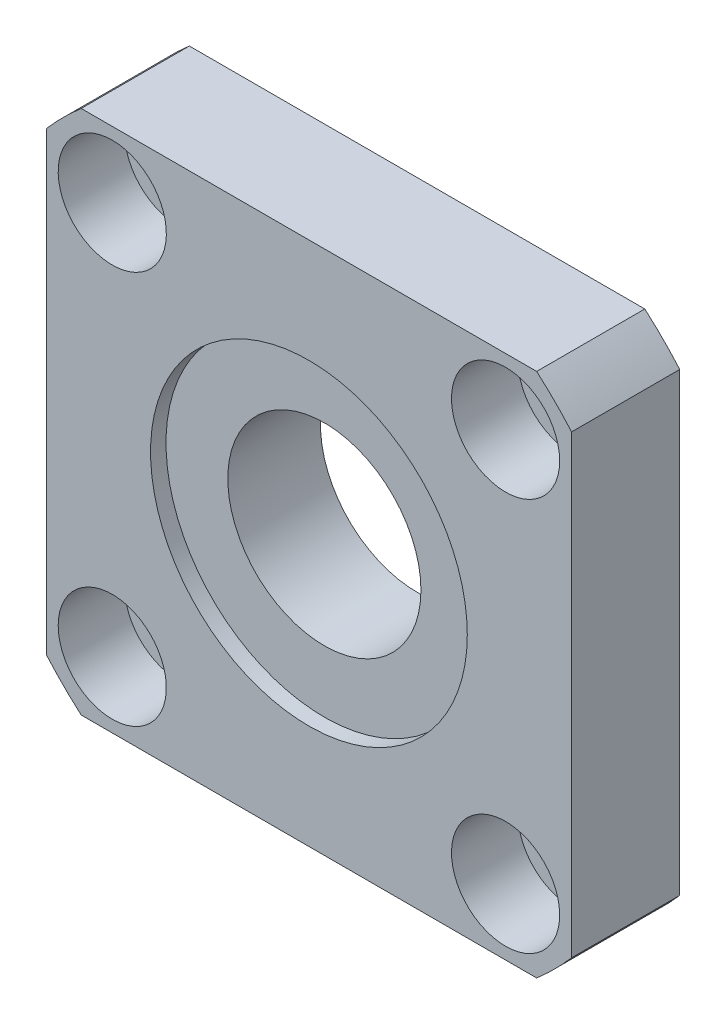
ISO-10303-21;
HEADER;
FILE_DESCRIPTION(('STEP AP214'),'2;1');
FILE_NAME('part.step','',(''),(''),'','','');
FILE_SCHEMA(('AUTOMOTIVE_DESIGN { 1 0 10303 214 1 1 1 1 }'));
ENDSEC;
DATA;
#1=APPLICATION_CONTEXT('core data for automotive mechanical design processes');
#2=APPLICATION_PROTOCOL_DEFINITION('international standard','automotive_design',2000,#1);
#3=PRODUCT_CONTEXT('',#1,'mechanical');
#4=PRODUCT('Part','Part','',(#3));
#5=PRODUCT_RELATED_PRODUCT_CATEGORY('part','',(#4));
#6=PRODUCT_DEFINITION_FORMATION('','',#4);
#7=PRODUCT_DEFINITION_CONTEXT('part definition',#1,'design');
#8=PRODUCT_DEFINITION('design','',#6,#7);
#9=PRODUCT_DEFINITION_SHAPE('','',#8);
#10=(LENGTH_UNIT() NAMED_UNIT(*) SI_UNIT(.MILLI.,.METRE.));
#11=(NAMED_UNIT(*) PLANE_ANGLE_UNIT() SI_UNIT($,.RADIAN.));
#12=(NAMED_UNIT(*) SI_UNIT($,.STERADIAN.) SOLID_ANGLE_UNIT());
#13=UNCERTAINTY_MEASURE_WITH_UNIT(LENGTH_MEASURE(1.E-05),#10,'distance_accuracy_value','');
#14=(GEOMETRIC_REPRESENTATION_CONTEXT(3) GLOBAL_UNCERTAINTY_ASSIGNED_CONTEXT((#13)) GLOBAL_UNIT_ASSIGNED_CONTEXT((#10,
#11,#12)) REPRESENTATION_CONTEXT('',''));
#15=CARTESIAN_POINT('',(0.,0.,0.));
#16=DIRECTION('',(0.,0.,1.));
#17=DIRECTION('',(1.,0.,0.));
#18=AXIS2_PLACEMENT_3D('',#15,#16,#17);
#19=CARTESIAN_POINT('',(0.,0.,14.));
#20=DIRECTION('',(0.,0.,-1.));
#21=DIRECTION('',(-1.,0.,0.));
#22=AXIS2_PLACEMENT_3D('',#19,#20,#21);
#23=CYLINDRICAL_SURFACE('',#22,12.5);
#24=CARTESIAN_POINT('',(0.,0.,0.));
#25=DIRECTION('',(0.,0.,1.));
#26=DIRECTION('',(1.,0.,0.));
#27=AXIS2_PLACEMENT_3D('',#24,#25,#26);
#28=CIRCLE('',#27,12.5);
#29=CARTESIAN_POINT('',(12.5,0.,0.));
#30=VERTEX_POINT('',#29);
#31=EDGE_CURVE('E95',#30,#30,#28,.T.);
#32=ORIENTED_EDGE('',*,*,#31,.F.);
#33=EDGE_LOOP('',(#32));
#34=FACE_BOUND('',#33,.T.);
#35=CARTESIAN_POINT('',(0.,0.,12.));
#36=DIRECTION('',(0.,0.,1.));
#37=DIRECTION('',(1.,0.,0.));
#38=AXIS2_PLACEMENT_3D('',#35,#36,#37);
#39=CIRCLE('',#38,12.5);
#40=CARTESIAN_POINT('',(12.5,0.,12.));
#41=VERTEX_POINT('',#40);
#42=EDGE_CURVE('E18',#41,#41,#39,.T.);
#43=ORIENTED_EDGE('',*,*,#42,.T.);
#44=EDGE_LOOP('',(#43));
#45=FACE_BOUND('',#44,.T.);
#46=ADVANCED_FACE('F14',(#34,#45),#23,.F.);
#47=CARTESIAN_POINT('',(-25.4558441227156,25.4558441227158,0.));
#48=DIRECTION('',(0.,0.,1.));
#49=DIRECTION('',(1.,0.,0.));
#50=AXIS2_PLACEMENT_3D('',#47,#48,#49);
#51=CYLINDRICAL_SURFACE('',#50,5.);
#52=CARTESIAN_POINT('',(-25.4558441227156,25.4558441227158,0.));
#53=DIRECTION('',(0.,0.,1.));
#54=DIRECTION('',(0.,1.,0.));
#55=AXIS2_PLACEMENT_3D('',#52,#53,#54);
#56=CIRCLE('',#55,5.);
#57=CARTESIAN_POINT('',(-25.4558441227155,30.4558441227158,0.));
#58=VERTEX_POINT('',#57);
#59=EDGE_CURVE('E158',#58,#58,#56,.T.);
#60=ORIENTED_EDGE('',*,*,#59,.F.);
#61=EDGE_LOOP('',(#60));
#62=FACE_BOUND('',#61,.T.);
#63=CARTESIAN_POINT('',(-25.4558441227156,25.4558441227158,5.4));
#64=DIRECTION('',(0.,0.,1.));
#65=DIRECTION('',(1.,0.,0.));
#66=AXIS2_PLACEMENT_3D('',#63,#64,#65);
#67=CIRCLE('',#66,5.);
#68=CARTESIAN_POINT('',(-20.4558441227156,25.4558441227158,5.4));
#69=VERTEX_POINT('',#68);
#70=EDGE_CURVE('E164',#69,#69,#67,.F.);
#71=ORIENTED_EDGE('',*,*,#70,.F.);
#72=EDGE_LOOP('',(#71));
#73=FACE_BOUND('',#72,.T.);
#74=ADVANCED_FACE('F206',(#62,#73),#51,.F.);
#75=CARTESIAN_POINT('',(-25.4558441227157,-25.4558441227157,0.));
#76=DIRECTION('',(0.,0.,1.));
#77=DIRECTION('',(1.,0.,0.));
#78=AXIS2_PLACEMENT_3D('',#75,#76,#77);
#79=CYLINDRICAL_SURFACE('',#78,5.);
#80=CARTESIAN_POINT('',(-25.4558441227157,-25.4558441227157,0.));
#81=DIRECTION('',(0.,0.,1.));
#82=DIRECTION('',(-1.,0.,0.));
#83=AXIS2_PLACEMENT_3D('',#80,#81,#82);
#84=CIRCLE('',#83,5.);
#85=CARTESIAN_POINT('',(-30.4558441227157,-25.4558441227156,0.));
#86=VERTEX_POINT('',#85);
#87=EDGE_CURVE('E189',#86,#86,#84,.T.);
#88=ORIENTED_EDGE('',*,*,#87,.F.);
#89=EDGE_LOOP('',(#88));
#90=FACE_BOUND('',#89,.T.);
#91=CARTESIAN_POINT('',(-25.4558441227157,-25.4558441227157,5.4));
#92=DIRECTION('',(0.,0.,1.));
#93=DIRECTION('',(1.,0.,0.));
#94=AXIS2_PLACEMENT_3D('',#91,#92,#93);
#95=CIRCLE('',#94,5.);
#96=CARTESIAN_POINT('',(-20.4558441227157,-25.4558441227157,5.4));
#97=VERTEX_POINT('',#96);
#98=EDGE_CURVE('E160',#97,#97,#95,.F.);
#99=ORIENTED_EDGE('',*,*,#98,.F.);
#100=EDGE_LOOP('',(#99));
#101=FACE_BOUND('',#100,.T.);
#102=ADVANCED_FACE('F288',(#90,#101),#79,.F.);
#103=CARTESIAN_POINT('',(25.4558441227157,-25.4558441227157,0.));
#104=DIRECTION('',(0.,0.,1.));
#105=DIRECTION('',(1.,0.,0.));
#106=AXIS2_PLACEMENT_3D('',#103,#104,#105);
#107=CYLINDRICAL_SURFACE('',#106,5.);
#108=CARTESIAN_POINT('',(25.4558441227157,-25.4558441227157,0.));
#109=DIRECTION('',(0.,0.,1.));
#110=DIRECTION('',(0.,-1.,0.));
#111=AXIS2_PLACEMENT_3D('',#108,#109,#110);
#112=CIRCLE('',#111,5.);
#113=CARTESIAN_POINT('',(25.4558441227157,-30.4558441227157,0.));
#114=VERTEX_POINT('',#113);
#115=EDGE_CURVE('E192',#114,#114,#112,.T.);
#116=ORIENTED_EDGE('',*,*,#115,.F.);
#117=EDGE_LOOP('',(#116));
#118=FACE_BOUND('',#117,.T.);
#119=CARTESIAN_POINT('',(25.4558441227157,-25.4558441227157,5.4));
#120=DIRECTION('',(0.,0.,1.));
#121=DIRECTION('',(1.,0.,0.));
#122=AXIS2_PLACEMENT_3D('',#119,#120,#121);
#123=CIRCLE('',#122,5.);
#124=CARTESIAN_POINT('',(30.4558441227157,-25.4558441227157,5.4));
#125=VERTEX_POINT('',#124);
#126=EDGE_CURVE('E155',#125,#125,#123,.F.);
#127=ORIENTED_EDGE('',*,*,#126,.F.);
#128=EDGE_LOOP('',(#127));
#129=FACE_BOUND('',#128,.T.);
#130=ADVANCED_FACE('F276',(#118,#129),#107,.F.);
#131=CARTESIAN_POINT('',(25.4558441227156,25.4558441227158,0.));
#132=DIRECTION('',(0.,0.,1.));
#133=DIRECTION('',(1.,0.,0.));
#134=AXIS2_PLACEMENT_3D('',#131,#132,#133);
#135=CYLINDRICAL_SURFACE('',#134,5.);
#136=CARTESIAN_POINT('',(25.4558441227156,25.4558441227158,0.));
#137=DIRECTION('',(0.,0.,1.));
#138=DIRECTION('',(1.,0.,0.));
#139=AXIS2_PLACEMENT_3D('',#136,#137,#138);
#140=CIRCLE('',#139,5.);
#141=CARTESIAN_POINT('',(30.4558441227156,25.4558441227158,0.));
#142=VERTEX_POINT('',#141);
#143=EDGE_CURVE('E153',#142,#142,#140,.T.);
#144=ORIENTED_EDGE('',*,*,#143,.F.);
#145=EDGE_LOOP('',(#144));
#146=FACE_BOUND('',#145,.T.);
#147=CARTESIAN_POINT('',(25.4558441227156,25.4558441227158,5.4));
#148=DIRECTION('',(0.,0.,1.));
#149=DIRECTION('',(1.,0.,0.));
#150=AXIS2_PLACEMENT_3D('',#147,#148,#149);
#151=CIRCLE('',#150,5.);
#152=CARTESIAN_POINT('',(30.4558441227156,25.4558441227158,5.4));
#153=VERTEX_POINT('',#152);
#154=EDGE_CURVE('E150',#153,#153,#151,.F.);
#155=ORIENTED_EDGE('',*,*,#154,.F.);
#156=EDGE_LOOP('',(#155));
#157=FACE_BOUND('',#156,.T.);
#158=ADVANCED_FACE('F225',(#146,#157),#135,.F.);
#159=CARTESIAN_POINT('',(0.,0.,14.));
#160=DIRECTION('',(0.,0.,1.));
#161=DIRECTION('',(1.,0.,0.));
#162=AXIS2_PLACEMENT_3D('',#159,#160,#161);
#163=PLANE('',#162);
#164=CARTESIAN_POINT('',(0.,0.,14.));
#165=DIRECTION('',(0.,0.,1.));
#166=DIRECTION('',(1.,0.,0.));
#167=AXIS2_PLACEMENT_3D('',#164,#165,#166);
#168=CIRCLE('',#167,20.5);
#169=CARTESIAN_POINT('',(20.5,0.,14.));
#170=VERTEX_POINT('',#169);
#171=EDGE_CURVE('E213',#170,#170,#168,.T.);
#172=ORIENTED_EDGE('',*,*,#171,.F.);
#173=EDGE_LOOP('',(#172));
#174=FACE_BOUND('',#173,.T.);
#175=CARTESIAN_POINT('',(-25.4558441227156,25.4558441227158,14.));
#176=DIRECTION('',(0.,0.,1.));
#177=DIRECTION('',(0.,1.,0.));
#178=AXIS2_PLACEMENT_3D('',#175,#176,#177);
#179=CIRCLE('',#178,7.);
#180=CARTESIAN_POINT('',(-25.4558441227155,32.4558441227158,14.));
#181=VERTEX_POINT('',#180);
#182=EDGE_CURVE('E173',#181,#181,#179,.T.);
#183=ORIENTED_EDGE('',*,*,#182,.F.);
#184=EDGE_LOOP('',(#183));
#185=FACE_BOUND('',#184,.T.);
#186=CARTESIAN_POINT('',(-25.4558441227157,-25.4558441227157,14.));
#187=DIRECTION('',(0.,0.,1.));
#188=DIRECTION('',(-1.,0.,0.));
#189=AXIS2_PLACEMENT_3D('',#186,#187,#188);
#190=CIRCLE('',#189,7.);
#191=CARTESIAN_POINT('',(-32.4558441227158,-25.4558441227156,14.));
#192=VERTEX_POINT('',#191);
#193=EDGE_CURVE('E166',#192,#192,#190,.T.);
#194=ORIENTED_EDGE('',*,*,#193,.F.);
#195=EDGE_LOOP('',(#194));
#196=FACE_BOUND('',#195,.T.);
#197=CARTESIAN_POINT('',(25.4558441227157,-25.4558441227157,14.));
#198=DIRECTION('',(0.,0.,1.));
#199=DIRECTION('',(0.,-1.,0.));
#200=AXIS2_PLACEMENT_3D('',#197,#198,#199);
#201=CIRCLE('',#200,7.);
#202=CARTESIAN_POINT('',(25.4558441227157,-32.4558441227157,14.));
#203=VERTEX_POINT('',#202);
#204=EDGE_CURVE('E162',#203,#203,#201,.T.);
#205=ORIENTED_EDGE('',*,*,#204,.F.);
#206=EDGE_LOOP('',(#205));
#207=FACE_BOUND('',#206,.T.);
#208=CARTESIAN_POINT('',(25.4558441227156,25.4558441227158,14.));
#209=DIRECTION('',(0.,0.,1.));
#210=DIRECTION('',(1.,0.,0.));
#211=AXIS2_PLACEMENT_3D('',#208,#209,#210);
#212=CIRCLE('',#211,7.);
#213=CARTESIAN_POINT('',(32.4558441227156,25.4558441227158,14.));
#214=VERTEX_POINT('',#213);
#215=EDGE_CURVE('E195',#214,#214,#212,.T.);
#216=ORIENTED_EDGE('',*,*,#215,.F.);
#217=EDGE_LOOP('',(#216));
#218=FACE_BOUND('',#217,.T.);
#219=CARTESIAN_POINT('',(0.,0.,14.));
#220=DIRECTION('',(0.,0.,1.));
#221=DIRECTION('',(1.,0.,0.));
#222=AXIS2_PLACEMENT_3D('',#219,#220,#221);
#223=CIRCLE('',#222,45.);
#224=CARTESIAN_POINT('',(34.,29.4788059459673,14.));
#225=VERTEX_POINT('',#224);
#226=CARTESIAN_POINT('',(29.4788059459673,34.,14.));
#227=VERTEX_POINT('',#226);
#228=EDGE_CURVE('E120',#225,#227,#223,.T.);
#229=ORIENTED_EDGE('',*,*,#228,.T.);
#230=DIRECTION('',(-1.,0.,0.));
#231=VECTOR('',#230,1.);
#232=CARTESIAN_POINT('',(29.4788059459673,34.,14.));
#233=LINE('',#232,#231);
#234=CARTESIAN_POINT('',(-29.4788059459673,34.,14.));
#235=VERTEX_POINT('',#234);
#236=EDGE_CURVE('E87',#227,#235,#233,.T.);
#237=ORIENTED_EDGE('',*,*,#236,.T.);
#238=CARTESIAN_POINT('',(0.,0.,14.));
#239=DIRECTION('',(0.,0.,-1.));
#240=DIRECTION('',(-1.,0.,0.));
#241=AXIS2_PLACEMENT_3D('',#238,#239,#240);
#242=CIRCLE('',#241,45.);
#243=CARTESIAN_POINT('',(-34.,29.4788059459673,14.));
#244=VERTEX_POINT('',#243);
#245=EDGE_CURVE('E123',#244,#235,#242,.T.);
#246=ORIENTED_EDGE('',*,*,#245,.F.);
#247=DIRECTION('',(0.,-1.,0.));
#248=VECTOR('',#247,1.);
#249=CARTESIAN_POINT('',(-34.,29.4788059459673,14.));
#250=LINE('',#249,#248);
#251=CARTESIAN_POINT('',(-34.,-29.4788059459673,14.));
#252=VERTEX_POINT('',#251);
#253=EDGE_CURVE('E126',#244,#252,#250,.T.);
#254=ORIENTED_EDGE('',*,*,#253,.T.);
#255=CARTESIAN_POINT('',(0.,0.,14.));
#256=DIRECTION('',(0.,0.,1.));
#257=DIRECTION('',(1.,0.,0.));
#258=AXIS2_PLACEMENT_3D('',#255,#256,#257);
#259=CIRCLE('',#258,45.);
#260=CARTESIAN_POINT('',(-29.4788059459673,-34.,14.));
#261=VERTEX_POINT('',#260);
#262=EDGE_CURVE('E129',#252,#261,#259,.T.);
#263=ORIENTED_EDGE('',*,*,#262,.T.);
#264=DIRECTION('',(-1.,0.,0.));
#265=VECTOR('',#264,1.);
#266=CARTESIAN_POINT('',(29.4788059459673,-34.,14.));
#267=LINE('',#266,#265);
#268=CARTESIAN_POINT('',(29.4788059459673,-34.,14.));
#269=VERTEX_POINT('',#268);
#270=EDGE_CURVE('E132',#269,#261,#267,.T.);
#271=ORIENTED_EDGE('',*,*,#270,.F.);
#272=CARTESIAN_POINT('',(0.,0.,14.));
#273=DIRECTION('',(0.,0.,-1.));
#274=DIRECTION('',(-1.,0.,0.));
#275=AXIS2_PLACEMENT_3D('',#272,#273,#274);
#276=CIRCLE('',#275,45.);
#277=CARTESIAN_POINT('',(34.,-29.4788059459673,14.));
#278=VERTEX_POINT('',#277);
#279=EDGE_CURVE('E135',#278,#269,#276,.T.);
#280=ORIENTED_EDGE('',*,*,#279,.F.);
#281=DIRECTION('',(0.,-1.,0.));
#282=VECTOR('',#281,1.);
#283=CARTESIAN_POINT('',(34.,29.4788059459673,14.));
#284=LINE('',#283,#282);
#285=EDGE_CURVE('E137',#225,#278,#284,.T.);
#286=ORIENTED_EDGE('',*,*,#285,.F.);
#287=EDGE_LOOP('',(#229,#237,#246,#254,#263,#271,#280,#286));
#288=FACE_BOUND('',#287,.T.);
#289=ADVANCED_FACE('F222',(#174,#185,#196,#207,#218,#288),#163,.T.);
#290=CARTESIAN_POINT('',(0.,0.,0.));
#291=DIRECTION('',(0.,0.,1.));
#292=DIRECTION('',(1.,0.,0.));
#293=AXIS2_PLACEMENT_3D('',#290,#291,#292);
#294=PLANE('',#293);
#295=ORIENTED_EDGE('',*,*,#59,.T.);
#296=EDGE_LOOP('',(#295));
#297=FACE_BOUND('',#296,.T.);
#298=ORIENTED_EDGE('',*,*,#87,.T.);
#299=EDGE_LOOP('',(#298));
#300=FACE_BOUND('',#299,.T.);
#301=ORIENTED_EDGE('',*,*,#115,.T.);
#302=EDGE_LOOP('',(#301));
#303=FACE_BOUND('',#302,.T.);
#304=ORIENTED_EDGE('',*,*,#143,.T.);
#305=EDGE_LOOP('',(#304));
#306=FACE_BOUND('',#305,.T.);
#307=CARTESIAN_POINT('',(0.,0.,0.));
#308=DIRECTION('',(0.,0.,1.));
#309=DIRECTION('',(1.,0.,0.));
#310=AXIS2_PLACEMENT_3D('',#307,#308,#309);
#311=CIRCLE('',#310,45.);
#312=CARTESIAN_POINT('',(34.,29.4788059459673,0.));
#313=VERTEX_POINT('',#312);
#314=CARTESIAN_POINT('',(29.4788059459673,34.,0.));
#315=VERTEX_POINT('',#314);
#316=EDGE_CURVE('E91',#313,#315,#311,.T.);
#317=ORIENTED_EDGE('',*,*,#316,.F.);
#318=DIRECTION('',(0.,-1.,0.));
#319=VECTOR('',#318,1.);
#320=CARTESIAN_POINT('',(34.,29.4788059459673,0.));
#321=LINE('',#320,#319);
#322=CARTESIAN_POINT('',(34.,-29.4788059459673,0.));
#323=VERTEX_POINT('',#322);
#324=EDGE_CURVE('E118',#313,#323,#321,.T.);
#325=ORIENTED_EDGE('',*,*,#324,.T.);
#326=CARTESIAN_POINT('',(0.,0.,0.));
#327=DIRECTION('',(0.,0.,-1.));
#328=DIRECTION('',(-1.,0.,0.));
#329=AXIS2_PLACEMENT_3D('',#326,#327,#328);
#330=CIRCLE('',#329,45.);
#331=CARTESIAN_POINT('',(29.4788059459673,-34.,0.));
#332=VERTEX_POINT('',#331);
#333=EDGE_CURVE('E115',#323,#332,#330,.T.);
#334=ORIENTED_EDGE('',*,*,#333,.T.);
#335=DIRECTION('',(-1.,0.,0.));
#336=VECTOR('',#335,1.);
#337=CARTESIAN_POINT('',(29.4788059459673,-34.,0.));
#338=LINE('',#337,#336);
#339=CARTESIAN_POINT('',(-29.4788059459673,-34.,0.));
#340=VERTEX_POINT('',#339);
#341=EDGE_CURVE('E112',#332,#340,#338,.T.);
#342=ORIENTED_EDGE('',*,*,#341,.T.);
#343=CARTESIAN_POINT('',(0.,0.,0.));
#344=DIRECTION('',(0.,0.,1.));
#345=DIRECTION('',(1.,0.,0.));
#346=AXIS2_PLACEMENT_3D('',#343,#344,#345);
#347=CIRCLE('',#346,45.);
#348=CARTESIAN_POINT('',(-34.,-29.4788059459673,0.));
#349=VERTEX_POINT('',#348);
#350=EDGE_CURVE('E109',#349,#340,#347,.T.);
#351=ORIENTED_EDGE('',*,*,#350,.F.);
#352=DIRECTION('',(0.,-1.,0.));
#353=VECTOR('',#352,1.);
#354=CARTESIAN_POINT('',(-34.,29.4788059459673,0.));
#355=LINE('',#354,#353);
#356=CARTESIAN_POINT('',(-34.,29.4788059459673,0.));
#357=VERTEX_POINT('',#356);
#358=EDGE_CURVE('E103',#357,#349,#355,.T.);
#359=ORIENTED_EDGE('',*,*,#358,.F.);
#360=CARTESIAN_POINT('',(0.,0.,0.));
#361=DIRECTION('',(0.,0.,-1.));
#362=DIRECTION('',(-1.,0.,0.));
#363=AXIS2_PLACEMENT_3D('',#360,#361,#362);
#364=CIRCLE('',#363,45.);
#365=CARTESIAN_POINT('',(-29.4788059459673,34.,0.));
#366=VERTEX_POINT('',#365);
#367=EDGE_CURVE('E101',#357,#366,#364,.T.);
#368=ORIENTED_EDGE('',*,*,#367,.T.);
#369=DIRECTION('',(-1.,0.,0.));
#370=VECTOR('',#369,1.);
#371=CARTESIAN_POINT('',(29.4788059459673,34.,0.));
#372=LINE('',#371,#370);
#373=EDGE_CURVE('E84',#315,#366,#372,.T.);
#374=ORIENTED_EDGE('',*,*,#373,.F.);
#375=EDGE_LOOP('',(#317,#325,#334,#342,#351,#359,#368,#374));
#376=FACE_BOUND('',#375,.T.);
#377=ORIENTED_EDGE('',*,*,#31,.T.);
#378=EDGE_LOOP('',(#377));
#379=FACE_BOUND('',#378,.T.);
#380=ADVANCED_FACE('F97',(#297,#300,#303,#306,#376,#379),#294,.F.);
#381=CARTESIAN_POINT('',(0.,0.,14.));
#382=DIRECTION('',(0.,0.,-1.));
#383=DIRECTION('',(-1.,0.,0.));
#384=AXIS2_PLACEMENT_3D('',#381,#382,#383);
#385=CYLINDRICAL_SURFACE('',#384,45.);
#386=DIRECTION('',(0.,0.,-1.));
#387=VECTOR('',#386,1.);
#388=CARTESIAN_POINT('',(29.4788059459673,34.,14.));
#389=LINE('',#388,#387);
#390=EDGE_CURVE('E9',#227,#315,#389,.T.);
#391=ORIENTED_EDGE('',*,*,#390,.F.);
#392=ORIENTED_EDGE('',*,*,#228,.F.);
#393=DIRECTION('',(0.,0.,-1.));
#394=VECTOR('',#393,1.);
#395=CARTESIAN_POINT('',(34.,29.4788059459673,14.));
#396=LINE('',#395,#394);
#397=EDGE_CURVE('E31',#225,#313,#396,.T.);
#398=ORIENTED_EDGE('',*,*,#397,.T.);
#399=ORIENTED_EDGE('',*,*,#316,.T.);
#400=EDGE_LOOP('',(#391,#392,#398,#399));
#401=FACE_BOUND('',#400,.T.);
#402=ADVANCED_FACE('F92',(#401),#385,.T.);
#403=CARTESIAN_POINT('',(29.4788059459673,34.,14.));
#404=DIRECTION('',(0.,-1.,0.));
#405=DIRECTION('',(0.,0.,-1.));
#406=AXIS2_PLACEMENT_3D('',#403,#404,#405);
#407=PLANE('',#406);
#408=DIRECTION('',(0.,0.,-1.));
#409=VECTOR('',#408,1.);
#410=CARTESIAN_POINT('',(-29.4788059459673,34.,14.));
#411=LINE('',#410,#409);
#412=EDGE_CURVE('E23',#235,#366,#411,.T.);
#413=ORIENTED_EDGE('',*,*,#412,.F.);
#414=ORIENTED_EDGE('',*,*,#236,.F.);
#415=ORIENTED_EDGE('',*,*,#390,.T.);
#416=ORIENTED_EDGE('',*,*,#373,.T.);
#417=EDGE_LOOP('',(#413,#414,#415,#416));
#418=FACE_BOUND('',#417,.T.);
#419=ADVANCED_FACE('F16',(#418),#407,.F.);
#420=CARTESIAN_POINT('',(0.,0.,14.));
#421=DIRECTION('',(0.,0.,-1.));
#422=DIRECTION('',(-1.,0.,0.));
#423=AXIS2_PLACEMENT_3D('',#420,#421,#422);
#424=CYLINDRICAL_SURFACE('',#423,45.);
#425=DIRECTION('',(0.,0.,-1.));
#426=VECTOR('',#425,1.);
#427=CARTESIAN_POINT('',(-34.,29.4788059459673,14.));
#428=LINE('',#427,#426);
#429=EDGE_CURVE('E147',#244,#357,#428,.T.);
#430=ORIENTED_EDGE('',*,*,#429,.F.);
#431=ORIENTED_EDGE('',*,*,#245,.T.);
#432=ORIENTED_EDGE('',*,*,#412,.T.);
#433=ORIENTED_EDGE('',*,*,#367,.F.);
#434=EDGE_LOOP('',(#430,#431,#432,#433));
#435=FACE_BOUND('',#434,.T.);
#436=ADVANCED_FACE('F251',(#435),#424,.T.);
#437=CARTESIAN_POINT('',(-34.,29.4788059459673,14.));
#438=DIRECTION('',(1.,0.,0.));
#439=DIRECTION('',(0.,0.,-1.));
#440=AXIS2_PLACEMENT_3D('',#437,#438,#439);
#441=PLANE('',#440);
#442=DIRECTION('',(0.,0.,-1.));
#443=VECTOR('',#442,1.);
#444=CARTESIAN_POINT('',(-34.,-29.4788059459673,14.));
#445=LINE('',#444,#443);
#446=EDGE_CURVE('E145',#252,#349,#445,.T.);
#447=ORIENTED_EDGE('',*,*,#446,.F.);
#448=ORIENTED_EDGE('',*,*,#253,.F.);
#449=ORIENTED_EDGE('',*,*,#429,.T.);
#450=ORIENTED_EDGE('',*,*,#358,.T.);
#451=EDGE_LOOP('',(#447,#448,#449,#450));
#452=FACE_BOUND('',#451,.T.);
#453=ADVANCED_FACE('F249',(#452),#441,.F.);
#454=CARTESIAN_POINT('',(0.,0.,14.));
#455=DIRECTION('',(0.,0.,-1.));
#456=DIRECTION('',(-1.,0.,0.));
#457=AXIS2_PLACEMENT_3D('',#454,#455,#456);
#458=CYLINDRICAL_SURFACE('',#457,45.);
#459=DIRECTION('',(0.,0.,-1.));
#460=VECTOR('',#459,1.);
#461=CARTESIAN_POINT('',(-29.4788059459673,-34.,14.));
#462=LINE('',#461,#460);
#463=EDGE_CURVE('E143',#261,#340,#462,.T.);
#464=ORIENTED_EDGE('',*,*,#463,.F.);
#465=ORIENTED_EDGE('',*,*,#262,.F.);
#466=ORIENTED_EDGE('',*,*,#446,.T.);
#467=ORIENTED_EDGE('',*,*,#350,.T.);
#468=EDGE_LOOP('',(#464,#465,#466,#467));
#469=FACE_BOUND('',#468,.T.);
#470=ADVANCED_FACE('F246',(#469),#458,.T.);
#471=CARTESIAN_POINT('',(29.4788059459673,-34.,14.));
#472=DIRECTION('',(0.,-1.,0.));
#473=DIRECTION('',(0.,0.,-1.));
#474=AXIS2_PLACEMENT_3D('',#471,#472,#473);
#475=PLANE('',#474);
#476=DIRECTION('',(0.,0.,-1.));
#477=VECTOR('',#476,1.);
#478=CARTESIAN_POINT('',(29.4788059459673,-34.,14.));
#479=LINE('',#478,#477);
#480=EDGE_CURVE('E141',#269,#332,#479,.T.);
#481=ORIENTED_EDGE('',*,*,#480,.F.);
#482=ORIENTED_EDGE('',*,*,#270,.T.);
#483=ORIENTED_EDGE('',*,*,#463,.T.);
#484=ORIENTED_EDGE('',*,*,#341,.F.);
#485=EDGE_LOOP('',(#481,#482,#483,#484));
#486=FACE_BOUND('',#485,.T.);
#487=ADVANCED_FACE('F243',(#486),#475,.T.);
#488=CARTESIAN_POINT('',(0.,0.,14.));
#489=DIRECTION('',(0.,0.,-1.));
#490=DIRECTION('',(-1.,0.,0.));
#491=AXIS2_PLACEMENT_3D('',#488,#489,#490);
#492=CYLINDRICAL_SURFACE('',#491,45.);
#493=DIRECTION('',(0.,0.,-1.));
#494=VECTOR('',#493,1.);
#495=CARTESIAN_POINT('',(34.,-29.4788059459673,14.));
#496=LINE('',#495,#494);
#497=EDGE_CURVE('E39',#278,#323,#496,.T.);
#498=ORIENTED_EDGE('',*,*,#497,.F.);
#499=ORIENTED_EDGE('',*,*,#279,.T.);
#500=ORIENTED_EDGE('',*,*,#480,.T.);
#501=ORIENTED_EDGE('',*,*,#333,.F.);
#502=EDGE_LOOP('',(#498,#499,#500,#501));
#503=FACE_BOUND('',#502,.T.);
#504=ADVANCED_FACE('F239',(#503),#492,.T.);
#505=CARTESIAN_POINT('',(34.,29.4788059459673,14.));
#506=DIRECTION('',(1.,0.,0.));
#507=DIRECTION('',(0.,0.,-1.));
#508=AXIS2_PLACEMENT_3D('',#505,#506,#507);
#509=PLANE('',#508);
#510=ORIENTED_EDGE('',*,*,#285,.T.);
#511=ORIENTED_EDGE('',*,*,#497,.T.);
#512=ORIENTED_EDGE('',*,*,#324,.F.);
#513=ORIENTED_EDGE('',*,*,#397,.F.);
#514=EDGE_LOOP('',(#510,#511,#512,#513));
#515=FACE_BOUND('',#514,.T.);
#516=ADVANCED_FACE('F238',(#515),#509,.T.);
#517=CARTESIAN_POINT('',(25.4558441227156,25.4558441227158,5.4));
#518=DIRECTION('',(0.,0.,1.));
#519=DIRECTION('',(1.,0.,0.));
#520=AXIS2_PLACEMENT_3D('',#517,#518,#519);
#521=PLANE('',#520);
#522=CARTESIAN_POINT('',(25.4558441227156,25.4558441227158,5.4));
#523=DIRECTION('',(0.,0.,1.));
#524=DIRECTION('',(1.,0.,0.));
#525=AXIS2_PLACEMENT_3D('',#522,#523,#524);
#526=CIRCLE('',#525,7.);
#527=CARTESIAN_POINT('',(32.4558441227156,25.4558441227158,5.4));
#528=VERTEX_POINT('',#527);
#529=EDGE_CURVE('E154',#528,#528,#526,.T.);
#530=ORIENTED_EDGE('',*,*,#529,.T.);
#531=EDGE_LOOP('',(#530));
#532=FACE_BOUND('',#531,.T.);
#533=ORIENTED_EDGE('',*,*,#154,.T.);
#534=EDGE_LOOP('',(#533));
#535=FACE_BOUND('',#534,.T.);
#536=ADVANCED_FACE('F268',(#532,#535),#521,.T.);
#537=CARTESIAN_POINT('',(25.4558441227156,25.4558441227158,5.4));
#538=DIRECTION('',(0.,0.,1.));
#539=DIRECTION('',(1.,0.,0.));
#540=AXIS2_PLACEMENT_3D('',#537,#538,#539);
#541=CYLINDRICAL_SURFACE('',#540,7.);
#542=ORIENTED_EDGE('',*,*,#529,.F.);
#543=EDGE_LOOP('',(#542));
#544=FACE_BOUND('',#543,.T.);
#545=ORIENTED_EDGE('',*,*,#215,.T.);
#546=EDGE_LOOP('',(#545));
#547=FACE_BOUND('',#546,.T.);
#548=ADVANCED_FACE('F278',(#544,#547),#541,.F.);
#549=CARTESIAN_POINT('',(25.4558441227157,-25.4558441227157,5.4));
#550=DIRECTION('',(0.,0.,1.));
#551=DIRECTION('',(0.,-1.,0.));
#552=AXIS2_PLACEMENT_3D('',#549,#550,#551);
#553=PLANE('',#552);
#554=CARTESIAN_POINT('',(25.4558441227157,-25.4558441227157,5.4));
#555=DIRECTION('',(0.,0.,1.));
#556=DIRECTION('',(0.,-1.,0.));
#557=AXIS2_PLACEMENT_3D('',#554,#555,#556);
#558=CIRCLE('',#557,7.);
#559=CARTESIAN_POINT('',(25.4558441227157,-32.4558441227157,5.4));
#560=VERTEX_POINT('',#559);
#561=EDGE_CURVE('E159',#560,#560,#558,.T.);
#562=ORIENTED_EDGE('',*,*,#561,.T.);
#563=EDGE_LOOP('',(#562));
#564=FACE_BOUND('',#563,.T.);
#565=ORIENTED_EDGE('',*,*,#126,.T.);
#566=EDGE_LOOP('',(#565));
#567=FACE_BOUND('',#566,.T.);
#568=ADVANCED_FACE('F281',(#564,#567),#553,.T.);
#569=CARTESIAN_POINT('',(25.4558441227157,-25.4558441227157,5.4));
#570=DIRECTION('',(0.,0.,1.));
#571=DIRECTION('',(1.,0.,0.));
#572=AXIS2_PLACEMENT_3D('',#569,#570,#571);
#573=CYLINDRICAL_SURFACE('',#572,7.);
#574=ORIENTED_EDGE('',*,*,#561,.F.);
#575=EDGE_LOOP('',(#574));
#576=FACE_BOUND('',#575,.T.);
#577=ORIENTED_EDGE('',*,*,#204,.T.);
#578=EDGE_LOOP('',(#577));
#579=FACE_BOUND('',#578,.T.);
#580=ADVANCED_FACE('F296',(#576,#579),#573,.F.);
#581=CARTESIAN_POINT('',(-25.4558441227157,-25.4558441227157,5.4));
#582=DIRECTION('',(0.,0.,1.));
#583=DIRECTION('',(-1.,0.,0.));
#584=AXIS2_PLACEMENT_3D('',#581,#582,#583);
#585=PLANE('',#584);
#586=CARTESIAN_POINT('',(-25.4558441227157,-25.4558441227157,5.4));
#587=DIRECTION('',(0.,0.,1.));
#588=DIRECTION('',(-1.,0.,0.));
#589=AXIS2_PLACEMENT_3D('',#586,#587,#588);
#590=CIRCLE('',#589,7.);
#591=CARTESIAN_POINT('',(-32.4558441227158,-25.4558441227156,5.4));
#592=VERTEX_POINT('',#591);
#593=EDGE_CURVE('E163',#592,#592,#590,.T.);
#594=ORIENTED_EDGE('',*,*,#593,.T.);
#595=EDGE_LOOP('',(#594));
#596=FACE_BOUND('',#595,.T.);
#597=ORIENTED_EDGE('',*,*,#98,.T.);
#598=EDGE_LOOP('',(#597));
#599=FACE_BOUND('',#598,.T.);
#600=ADVANCED_FACE('F299',(#596,#599),#585,.T.);
#601=CARTESIAN_POINT('',(-25.4558441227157,-25.4558441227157,5.4));
#602=DIRECTION('',(0.,0.,1.));
#603=DIRECTION('',(1.,0.,0.));
#604=AXIS2_PLACEMENT_3D('',#601,#602,#603);
#605=CYLINDRICAL_SURFACE('',#604,7.);
#606=ORIENTED_EDGE('',*,*,#593,.F.);
#607=EDGE_LOOP('',(#606));
#608=FACE_BOUND('',#607,.T.);
#609=ORIENTED_EDGE('',*,*,#193,.T.);
#610=EDGE_LOOP('',(#609));
#611=FACE_BOUND('',#610,.T.);
#612=ADVANCED_FACE('F304',(#608,#611),#605,.F.);
#613=CARTESIAN_POINT('',(-25.4558441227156,25.4558441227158,5.4));
#614=DIRECTION('',(0.,0.,1.));
#615=DIRECTION('',(0.,1.,0.));
#616=AXIS2_PLACEMENT_3D('',#613,#614,#615);
#617=PLANE('',#616);
#618=CARTESIAN_POINT('',(-25.4558441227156,25.4558441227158,5.4));
#619=DIRECTION('',(0.,0.,1.));
#620=DIRECTION('',(0.,1.,0.));
#621=AXIS2_PLACEMENT_3D('',#618,#619,#620);
#622=CIRCLE('',#621,7.);
#623=CARTESIAN_POINT('',(-25.4558441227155,32.4558441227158,5.4));
#624=VERTEX_POINT('',#623);
#625=EDGE_CURVE('E167',#624,#624,#622,.T.);
#626=ORIENTED_EDGE('',*,*,#625,.T.);
#627=EDGE_LOOP('',(#626));
#628=FACE_BOUND('',#627,.T.);
#629=ORIENTED_EDGE('',*,*,#70,.T.);
#630=EDGE_LOOP('',(#629));
#631=FACE_BOUND('',#630,.T.);
#632=ADVANCED_FACE('F307',(#628,#631),#617,.T.);
#633=CARTESIAN_POINT('',(-25.4558441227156,25.4558441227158,5.4));
#634=DIRECTION('',(0.,0.,1.));
#635=DIRECTION('',(1.,0.,0.));
#636=AXIS2_PLACEMENT_3D('',#633,#634,#635);
#637=CYLINDRICAL_SURFACE('',#636,7.);
#638=ORIENTED_EDGE('',*,*,#625,.F.);
#639=EDGE_LOOP('',(#638));
#640=FACE_BOUND('',#639,.T.);
#641=ORIENTED_EDGE('',*,*,#182,.T.);
#642=EDGE_LOOP('',(#641));
#643=FACE_BOUND('',#642,.T.);
#644=ADVANCED_FACE('F312',(#640,#643),#637,.F.);
#645=CARTESIAN_POINT('',(0.,0.,12.));
#646=DIRECTION('',(0.,0.,1.));
#647=DIRECTION('',(1.,0.,0.));
#648=AXIS2_PLACEMENT_3D('',#645,#646,#647);
#649=CYLINDRICAL_SURFACE('',#648,20.5);
#650=CARTESIAN_POINT('',(0.,0.,12.));
#651=DIRECTION('',(0.,0.,1.));
#652=DIRECTION('',(1.,0.,0.));
#653=AXIS2_PLACEMENT_3D('',#650,#651,#652);
#654=CIRCLE('',#653,20.5);
#655=CARTESIAN_POINT('',(20.5,0.,12.));
#656=VERTEX_POINT('',#655);
#657=EDGE_CURVE('E211',#656,#656,#654,.T.);
#658=ORIENTED_EDGE('',*,*,#657,.F.);
#659=EDGE_LOOP('',(#658));
#660=FACE_BOUND('',#659,.T.);
#661=ORIENTED_EDGE('',*,*,#171,.T.);
#662=EDGE_LOOP('',(#661));
#663=FACE_BOUND('',#662,.T.);
#664=ADVANCED_FACE('F220',(#660,#663),#649,.F.);
#665=CARTESIAN_POINT('',(0.,0.,12.));
#666=DIRECTION('',(0.,0.,1.));
#667=DIRECTION('',(1.,0.,0.));
#668=AXIS2_PLACEMENT_3D('',#665,#666,#667);
#669=PLANE('',#668);
#670=ORIENTED_EDGE('',*,*,#42,.F.);
#671=EDGE_LOOP('',(#670));
#672=FACE_BOUND('',#671,.T.);
#673=ORIENTED_EDGE('',*,*,#657,.T.);
#674=EDGE_LOOP('',(#673));
#675=FACE_BOUND('',#674,.T.);
#676=ADVANCED_FACE('F316',(#672,#675),#669,.T.);
#677=CLOSED_SHELL('',(#46,#74,#102,#130,#158,#289,#380,#402,#419,#436,#453,#470,#487,#504,#516,
#536,#548,#568,#580,#600,#612,#632,#644,#664,#676));
#678=MANIFOLD_SOLID_BREP('B1',#677);
#679=ADVANCED_BREP_SHAPE_REPRESENTATION('',(#18,#678),#14);
#680=SHAPE_DEFINITION_REPRESENTATION(#9,#679);
ENDSEC;
END-ISO-10303-21;
